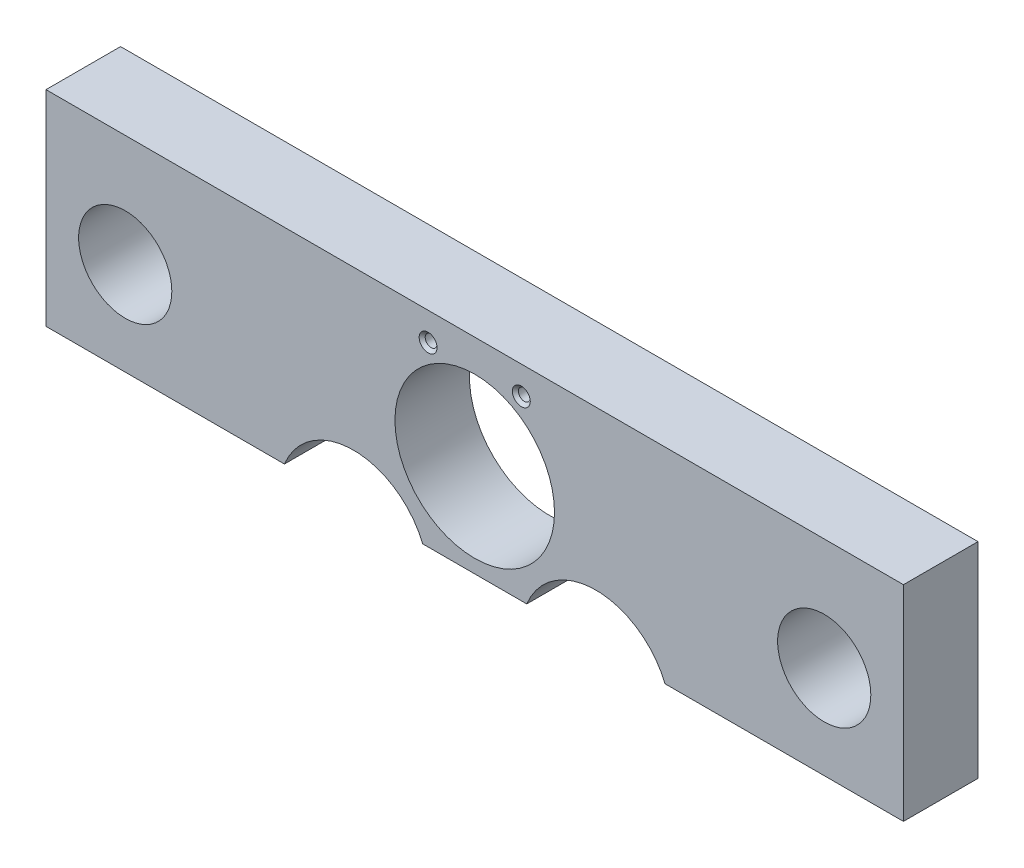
from build123d import *

# Parameters (mm, degrees)
SKETCH1_W                            = 292.1
SKETCH1_H                            = 76.2
BOSS_EXTRUDE1_DEPTH                  = 25.4
CUT_EXTRUDE1_DEPTH                   = 303.942255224
CUT_EXTRUDE1_DEPTH_BACK              = 303.942255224
SKETCH2_R                            = 27.178
F_1_2_1_25_DIAMETER_HOLE1_D          = 31.75
SKETCH6_R                            = 25.4
CUT_EXTRUDE2_DEPTH                   = 303.942255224
CUT_EXTRUDE3_DEPTH                   = 303.942255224
CUT_EXTRUDE3_DEPTH_BACK              = 303.942255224
SKETCH7_W                            = 292.1
SKETCH7_H                            = 6.35
DOUBLE_10_32_TAPPED_HOLE2_AT_2_COUNT = 2
DOUBLE_10_32_TAPPED_HOLE2_AT_2_PITCH = 31.75


with BuildPart() as part:
    # Sketch1 → Boss-Extrude1 (new body)
    with BuildSketch(Plane.XY):
        with Locations((146.05, 38.1)):
            Rectangle(SKETCH1_W, SKETCH1_H)
    extrude(amount=BOSS_EXTRUDE1_DEPTH)

    # Sketch2 → Cut-Extrude1 (cut, two sides: drawn at the far end of the back side and taken through both)
    with BuildSketch(Plane.XY.offset(25.4).offset(-CUT_EXTRUDE1_DEPTH_BACK)):
        with Locations((146.05, 38.1)):
            Circle(SKETCH2_R)
    extrude(amount=CUT_EXTRUDE1_DEPTH + CUT_EXTRUDE1_DEPTH_BACK, mode=Mode.SUBTRACT)

    # 1_2 _1.25_ Diameter Hole1 (through all)
    with Locations(Plane.XY.offset(25.4)):
        with Locations((26.9875, 38.1), (265.1125, 38.1)):
            Hole(F_1_2_1_25_DIAMETER_HOLE1_D / 2)

    # Sketch6 → Cut-Extrude2 (cut, through all)
    with BuildSketch(Plane.XY.offset(25.4)):
        with Locations((104.775, -3.175)):
            Circle(SKETCH6_R)
        with Locations((187.325, -3.175)):
            Circle(SKETCH6_R)
    extrude(amount=-CUT_EXTRUDE2_DEPTH, mode=Mode.SUBTRACT)

    # Sketch7 → Cut-Extrude3 (cut, two sides: drawn at the far end of the back side and taken through both)
    with BuildSketch(Plane.XY.offset(25.4).offset(-CUT_EXTRUDE3_DEPTH_BACK)):
        with Locations((146.05, 3.175)):
            Rectangle(SKETCH7_W, SKETCH7_H)
    extrude(amount=CUT_EXTRUDE3_DEPTH + CUT_EXTRUDE3_DEPTH_BACK, mode=Mode.SUBTRACT)

    # Sketch14 → Double _10-32 Tapped Hole2 (revolve, cut)
    with BuildSketch(Plane(origin=(130.175, 66.675, 25.4), x_dir=(0, -1, 0), z_dir=(1, 0, 0))):
        Polygon((0, 0), (0, 25.4), (3.048, 25.4), (2.0193, 24.3713), (2.0193, 1.0287), (3.048, 0), align=None)
    double_10_32_tapped_hole2 = revolve(axis=Axis((130.175, 66.675, 31.75), (0, 0, -1)), mode=Mode.SUBTRACT)

    # Double _10-32 Tapped Hole2 at 2: Double _10-32 Tapped Hole2 ×2
    with Locations(*[(i * DOUBLE_10_32_TAPPED_HOLE2_AT_2_PITCH, 0, 0) for i in range(1, DOUBLE_10_32_TAPPED_HOLE2_AT_2_COUNT)]):
        add(double_10_32_tapped_hole2, mode=Mode.SUBTRACT)


solid = part.part
